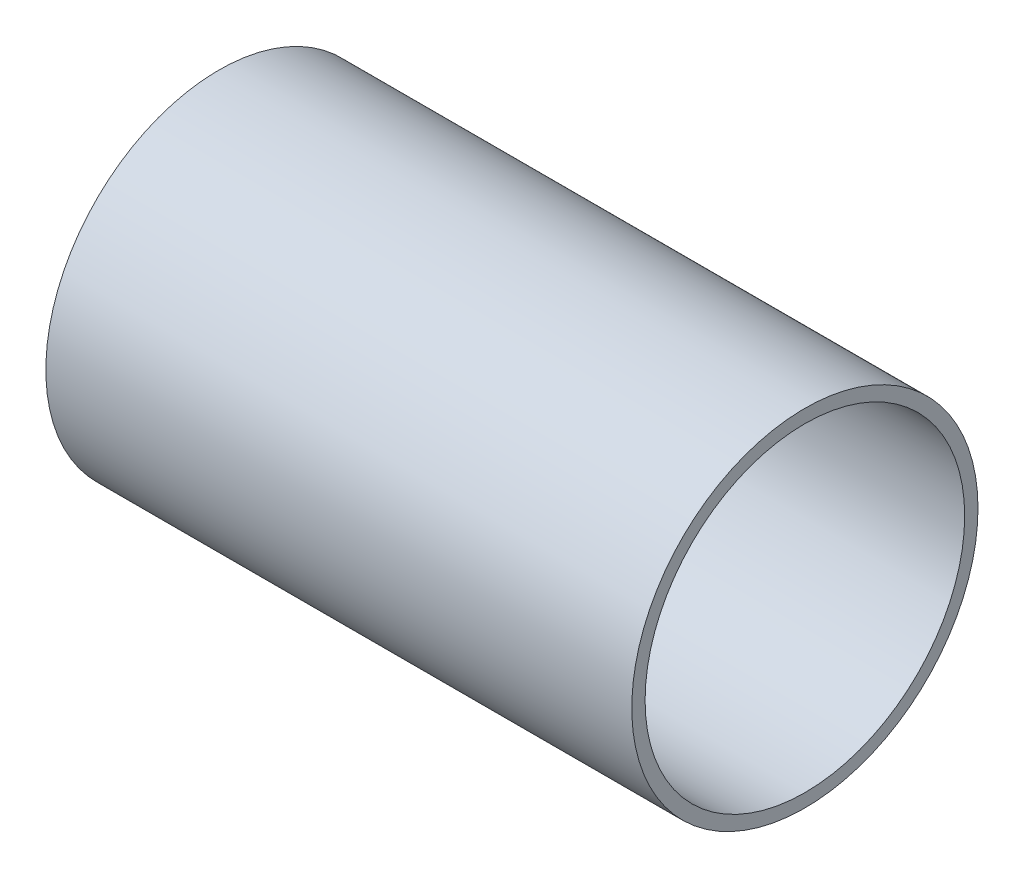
from build123d import *

# Parameters (mm, degrees)
SKETCH1_W = 139.7
SKETCH1_H = 3.175


with BuildPart() as part:
    # Sketch1 → Revolve1 (revolve)
    with BuildSketch(Plane.XY, mode=Mode.PRIVATE) as revolve1_sk:
        with Locations((69.85, 39.6875)):
            Rectangle(SKETCH1_W, SKETCH1_H)
    revolve(revolve1_sk.sketch.rotate(Axis((-8.921487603, 0, 0), (-1, 0, 0)), 90), axis=Axis((-8.921487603, 0, 0), (-1, 0, 0)))


solid = part.part
